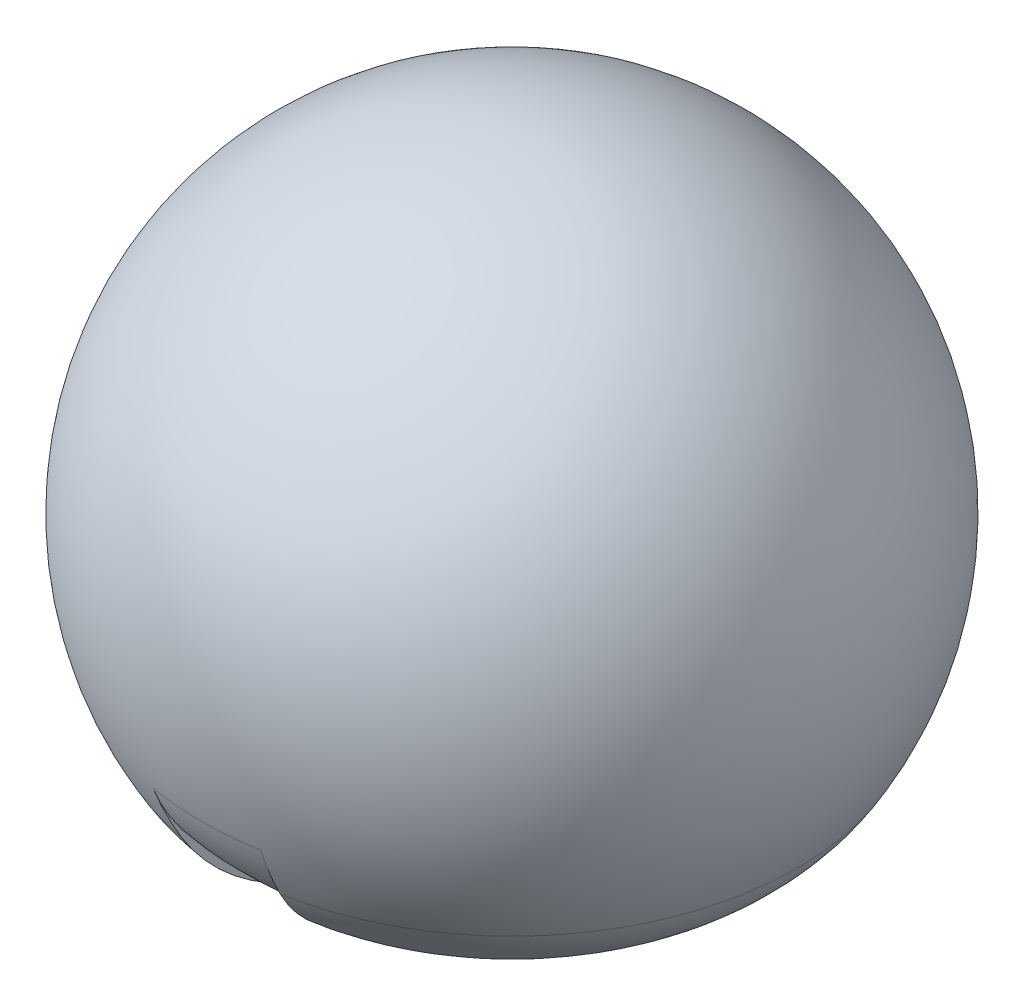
ISO-10303-21;
HEADER;
FILE_DESCRIPTION(('STEP AP214'),'2;1');
FILE_NAME('part.step','',(''),(''),'','','');
FILE_SCHEMA(('AUTOMOTIVE_DESIGN { 1 0 10303 214 1 1 1 1 }'));
ENDSEC;
DATA;
#1=APPLICATION_CONTEXT('core data for automotive mechanical design processes');
#2=APPLICATION_PROTOCOL_DEFINITION('international standard','automotive_design',2000,#1);
#3=PRODUCT_CONTEXT('',#1,'mechanical');
#4=PRODUCT('Part','Part','',(#3));
#5=PRODUCT_RELATED_PRODUCT_CATEGORY('part','',(#4));
#6=PRODUCT_DEFINITION_FORMATION('','',#4);
#7=PRODUCT_DEFINITION_CONTEXT('part definition',#1,'design');
#8=PRODUCT_DEFINITION('design','',#6,#7);
#9=PRODUCT_DEFINITION_SHAPE('','',#8);
#10=(LENGTH_UNIT() NAMED_UNIT(*) SI_UNIT(.MILLI.,.METRE.));
#11=(NAMED_UNIT(*) PLANE_ANGLE_UNIT() SI_UNIT($,.RADIAN.));
#12=(NAMED_UNIT(*) SI_UNIT($,.STERADIAN.) SOLID_ANGLE_UNIT());
#13=UNCERTAINTY_MEASURE_WITH_UNIT(LENGTH_MEASURE(1.E-05),#10,'distance_accuracy_value','');
#14=(GEOMETRIC_REPRESENTATION_CONTEXT(3) GLOBAL_UNCERTAINTY_ASSIGNED_CONTEXT((#13)) GLOBAL_UNIT_ASSIGNED_CONTEXT((#10,
#11,#12)) REPRESENTATION_CONTEXT('',''));
#15=CARTESIAN_POINT('',(0.,0.,0.));
#16=DIRECTION('',(0.,0.,1.));
#17=DIRECTION('',(1.,0.,0.));
#18=AXIS2_PLACEMENT_3D('',#15,#16,#17);
#19=CARTESIAN_POINT('',(-202.363452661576,395.,1147.66017003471));
#20=DIRECTION('',(-0.984807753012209,0.,-0.173648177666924));
#21=DIRECTION('',(-0.173648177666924,0.,0.984807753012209));
#22=AXIS2_PLACEMENT_3D('',#19,#20,#21);
#23=PLANE('',#22);
#24=CARTESIAN_POINT('',(39.0997706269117,199.999999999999,-221.745818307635));
#25=DIRECTION('',(-0.984807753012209,0.,-0.173648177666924));
#26=DIRECTION('',(-0.173648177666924,0.,0.984807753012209));
#27=AXIS2_PLACEMENT_3D('',#24,#25,#26);
#28=CIRCLE('',#27,300.235324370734);
#29=CARTESIAN_POINT('',(-13.0034418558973,189.465191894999,73.7461833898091));
#30=VERTEX_POINT('',#29);
#31=CARTESIAN_POINT('',(2.98472361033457E-13,1.40178752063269,-1.69272087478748E-12));
#32=VERTEX_POINT('',#31);
#33=EDGE_CURVE('E94',#30,#32,#28,.F.);
#34=ORIENTED_EDGE('',*,*,#33,.F.);
#35=CARTESIAN_POINT('',(0.,330.,1.2490952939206E-13));
#36=DIRECTION('',(-0.984807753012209,0.,-0.173648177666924));
#37=DIRECTION('',(-0.173648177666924,0.,0.984807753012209));
#38=AXIS2_PLACEMENT_3D('',#35,#36,#37);
#39=CIRCLE('',#38,159.240765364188);
#40=CARTESIAN_POINT('',(-10.3358010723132,477.698380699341,58.6172407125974));
#41=VERTEX_POINT('',#40);
#42=EDGE_CURVE('E106',#30,#41,#39,.T.);
#43=ORIENTED_EDGE('',*,*,#42,.T.);
#44=CARTESIAN_POINT('',(-42.4257369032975,241.074762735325,240.608310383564));
#45=DIRECTION('',(-0.984807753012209,0.,-0.173648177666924));
#46=DIRECTION('',(-0.173648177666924,0.,0.984807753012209));
#47=AXIS2_PLACEMENT_3D('',#44,#45,#46);
#48=CIRCLE('',#47,300.235324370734);
#49=CARTESIAN_POINT('',(-40.5963866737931,541.125204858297,230.233549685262));
#50=VERTEX_POINT('',#49);
#51=EDGE_CURVE('E57',#41,#50,#48,.F.);
#52=ORIENTED_EDGE('',*,*,#51,.T.);
#53=CARTESIAN_POINT('',(0.,330.,0.));
#54=DIRECTION('',(-0.984807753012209,0.,-0.173648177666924));
#55=DIRECTION('',(-0.173648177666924,0.,0.984807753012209));
#56=AXIS2_PLACEMENT_3D('',#53,#54,#55);
#57=CIRCLE('',#56,315.006993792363);
#58=CARTESIAN_POINT('',(-7.53307391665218,17.9944330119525,42.7221851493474));
#59=VERTEX_POINT('',#58);
#60=EDGE_CURVE('E52',#50,#59,#57,.F.);
#61=ORIENTED_EDGE('',*,*,#60,.T.);
#62=CARTESIAN_POINT('',(-42.4257369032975,241.074762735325,240.608310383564));
#63=DIRECTION('',(-0.984807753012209,0.,-0.173648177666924));
#64=DIRECTION('',(-0.173648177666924,0.,0.984807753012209));
#65=AXIS2_PLACEMENT_3D('',#62,#63,#64);
#66=CIRCLE('',#65,300.235324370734);
#67=CARTESIAN_POINT('',(-91.4169095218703,138.388234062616,518.451056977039));
#68=VERTEX_POINT('',#67);
#69=EDGE_CURVE('E141',#68,#59,#66,.F.);
#70=ORIENTED_EDGE('',*,*,#69,.F.);
#71=CARTESIAN_POINT('',(0.,330.,1.2490952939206E-13));
#72=DIRECTION('',(-0.984807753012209,0.,-0.173648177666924));
#73=DIRECTION('',(-0.173648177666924,0.,0.984807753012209));
#74=AXIS2_PLACEMENT_3D('',#71,#72,#73);
#75=CIRCLE('',#74,560.235324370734);
#76=CARTESIAN_POINT('',(-84.2502795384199,49.8823378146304,477.807078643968));
#77=VERTEX_POINT('',#76);
#78=EDGE_CURVE('E116',#77,#68,#75,.T.);
#79=ORIENTED_EDGE('',*,*,#78,.F.);
#80=CARTESIAN_POINT('',(-39.0997706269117,199.999999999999,221.745818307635));
#81=DIRECTION('',(-0.984807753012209,0.,-0.173648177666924));
#82=DIRECTION('',(-0.173648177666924,0.,0.984807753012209));
#83=AXIS2_PLACEMENT_3D('',#80,#81,#82);
#84=CIRCLE('',#83,300.235324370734);
#85=EDGE_CURVE('E112',#32,#77,#84,.T.);
#86=ORIENTED_EDGE('',*,*,#85,.F.);
#87=EDGE_LOOP('',(#34,#43,#52,#61,#70,#79,#86));
#88=FACE_BOUND('',#87,.T.);
#89=ADVANCED_FACE('F37',(#88),#23,.F.);
#90=CARTESIAN_POINT('',(202.363452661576,395.,1147.66017003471));
#91=DIRECTION('',(-0.984807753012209,0.,0.173648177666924));
#92=DIRECTION('',(0.173648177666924,0.,0.984807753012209));
#93=AXIS2_PLACEMENT_3D('',#90,#91,#92);
#94=PLANE('',#93);
#95=CARTESIAN_POINT('',(0.,330.,1.2490952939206E-13));
#96=DIRECTION('',(-0.984807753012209,0.,0.173648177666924));
#97=DIRECTION('',(0.173648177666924,0.,0.984807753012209));
#98=AXIS2_PLACEMENT_3D('',#95,#96,#97);
#99=CIRCLE('',#98,159.240765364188);
#100=CARTESIAN_POINT('',(13.0034418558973,189.465191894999,73.7461833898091));
#101=VERTEX_POINT('',#100);
#102=CARTESIAN_POINT('',(10.3358010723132,477.698380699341,58.6172407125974));
#103=VERTEX_POINT('',#102);
#104=EDGE_CURVE('E104',#101,#103,#99,.T.);
#105=ORIENTED_EDGE('',*,*,#104,.F.);
#106=CARTESIAN_POINT('',(-39.0997706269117,199.999999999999,-221.745818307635));
#107=DIRECTION('',(-0.984807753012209,0.,0.173648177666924));
#108=DIRECTION('',(0.173648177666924,0.,0.984807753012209));
#109=AXIS2_PLACEMENT_3D('',#106,#107,#108);
#110=CIRCLE('',#109,300.235324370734);
#111=EDGE_CURVE('E89',#101,#32,#110,.F.);
#112=ORIENTED_EDGE('',*,*,#111,.T.);
#113=CARTESIAN_POINT('',(39.0997706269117,199.999999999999,221.745818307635));
#114=DIRECTION('',(-0.984807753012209,0.,0.173648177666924));
#115=DIRECTION('',(0.173648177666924,0.,0.984807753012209));
#116=AXIS2_PLACEMENT_3D('',#113,#114,#115);
#117=CIRCLE('',#116,300.235324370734);
#118=CARTESIAN_POINT('',(84.2502795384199,49.8823378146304,477.807078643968));
#119=VERTEX_POINT('',#118);
#120=EDGE_CURVE('E118',#32,#119,#117,.T.);
#121=ORIENTED_EDGE('',*,*,#120,.T.);
#122=CARTESIAN_POINT('',(0.,330.,1.2490952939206E-13));
#123=DIRECTION('',(-0.984807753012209,0.,0.173648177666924));
#124=DIRECTION('',(0.173648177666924,0.,0.984807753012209));
#125=AXIS2_PLACEMENT_3D('',#122,#123,#124);
#126=CIRCLE('',#125,560.235324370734);
#127=CARTESIAN_POINT('',(91.4169095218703,138.388234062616,518.451056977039));
#128=VERTEX_POINT('',#127);
#129=EDGE_CURVE('E113',#119,#128,#126,.T.);
#130=ORIENTED_EDGE('',*,*,#129,.T.);
#131=CARTESIAN_POINT('',(42.4257369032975,241.074762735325,240.608310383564));
#132=DIRECTION('',(-0.984807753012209,0.,0.173648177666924));
#133=DIRECTION('',(0.173648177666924,0.,0.984807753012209));
#134=AXIS2_PLACEMENT_3D('',#131,#132,#133);
#135=CIRCLE('',#134,300.235324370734);
#136=CARTESIAN_POINT('',(7.53307391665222,17.9944330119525,42.7221851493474));
#137=VERTEX_POINT('',#136);
#138=EDGE_CURVE('E11',#128,#137,#135,.F.);
#139=ORIENTED_EDGE('',*,*,#138,.T.);
#140=CARTESIAN_POINT('',(0.,330.,0.));
#141=DIRECTION('',(-0.984807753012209,0.,0.173648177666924));
#142=DIRECTION('',(0.173648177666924,0.,0.984807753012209));
#143=AXIS2_PLACEMENT_3D('',#140,#141,#142);
#144=CIRCLE('',#143,315.006993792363);
#145=CARTESIAN_POINT('',(40.5963866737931,541.125204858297,230.233549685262));
#146=VERTEX_POINT('',#145);
#147=EDGE_CURVE('E45',#146,#137,#144,.F.);
#148=ORIENTED_EDGE('',*,*,#147,.F.);
#149=CARTESIAN_POINT('',(42.4257369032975,241.074762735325,240.608310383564));
#150=DIRECTION('',(-0.984807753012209,0.,0.173648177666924));
#151=DIRECTION('',(0.173648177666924,0.,0.984807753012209));
#152=AXIS2_PLACEMENT_3D('',#149,#150,#151);
#153=CIRCLE('',#152,300.235324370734);
#154=EDGE_CURVE('E110',#103,#146,#153,.F.);
#155=ORIENTED_EDGE('',*,*,#154,.F.);
#156=EDGE_LOOP('',(#105,#112,#121,#130,#139,#148,#155));
#157=FACE_BOUND('',#156,.T.);
#158=ADVANCED_FACE('F108',(#157),#94,.T.);
#159=CARTESIAN_POINT('',(0.,199.999999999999,-225.166604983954));
#160=DIRECTION('',(-1.,0.,0.));
#161=DIRECTION('',(0.,0.,-1.));
#162=AXIS2_PLACEMENT_3D('',#159,#160,#161);
#163=CIRCLE('',#162,300.235324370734);
#164=TRIMMED_CURVE('',#163,(PARAMETER_VALUE(-2.41880861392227)),
(PARAMETER_VALUE(2.41880861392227)),.T.,.PARAMETER.);
#165=CARTESIAN_POINT('',(0.,199.999999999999,0.));
#166=DIRECTION('',(0.,-1.,0.));
#167=AXIS1_PLACEMENT('',#165,#166);
#168=SURFACE_OF_REVOLUTION('',#164,#167);
#169=CARTESIAN_POINT('',(0.,49.8823378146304,0.));
#170=DIRECTION('',(0.,-1.,0.));
#171=DIRECTION('',(0.,0.,-1.));
#172=AXIS2_PLACEMENT_3D('',#169,#170,#171);
#173=CIRCLE('',#172,485.17802300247);
#174=EDGE_CURVE('E125',#77,#119,#173,.T.);
#175=ORIENTED_EDGE('',*,*,#174,.T.);
#176=ORIENTED_EDGE('',*,*,#120,.F.);
#177=ORIENTED_EDGE('',*,*,#85,.T.);
#178=EDGE_LOOP('',(#175,#176,#177));
#179=FACE_BOUND('',#178,.T.);
#180=ADVANCED_FACE('F39',(#179),#168,.T.);
#181=CARTESIAN_POINT('',(0.,330.,1.2490952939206E-13));
#182=DIRECTION('',(0.,-1.,0.));
#183=DIRECTION('',(-0.173648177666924,0.,0.984807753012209));
#184=AXIS2_PLACEMENT_3D('',#181,#182,#183);
#185=SPHERICAL_SURFACE('',#184,560.235324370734);
#186=CARTESIAN_POINT('',(0.,138.388234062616,0.));
#187=DIRECTION('',(0.,-1.,0.));
#188=DIRECTION('',(0.,0.,-1.));
#189=AXIS2_PLACEMENT_3D('',#186,#187,#188);
#190=CIRCLE('',#189,526.449000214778);
#191=EDGE_CURVE('E142',#128,#68,#190,.T.);
#192=ORIENTED_EDGE('',*,*,#191,.F.);
#193=ORIENTED_EDGE('',*,*,#129,.F.);
#194=ORIENTED_EDGE('',*,*,#174,.F.);
#195=ORIENTED_EDGE('',*,*,#78,.T.);
#196=EDGE_LOOP('',(#192,#193,#194,#195));
#197=FACE_BOUND('',#196,.T.);
#198=ADVANCED_FACE('F155',(#197),#185,.T.);
#199=CARTESIAN_POINT('',(0.,330.,1.2490952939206E-13));
#200=DIRECTION('',(0.,-1.,0.));
#201=DIRECTION('',(0.173648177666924,0.,-0.984807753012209));
#202=AXIS2_PLACEMENT_3D('',#199,#200,#201);
#203=SPHERICAL_SURFACE('',#202,159.240765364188);
#204=ORIENTED_EDGE('',*,*,#42,.F.);
#205=CARTESIAN_POINT('',(0.,189.465191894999,0.));
#206=DIRECTION('',(0.,-1.,0.));
#207=DIRECTION('',(0.,0.,-1.));
#208=AXIS2_PLACEMENT_3D('',#205,#206,#207);
#209=CIRCLE('',#208,74.8838371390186);
#210=EDGE_CURVE('E92',#101,#30,#209,.T.);
#211=ORIENTED_EDGE('',*,*,#210,.F.);
#212=ORIENTED_EDGE('',*,*,#104,.T.);
#213=CARTESIAN_POINT('',(0.,477.698380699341,0.));
#214=DIRECTION('',(0.,-1.,0.));
#215=DIRECTION('',(0.,0.,-1.));
#216=AXIS2_PLACEMENT_3D('',#213,#214,#215);
#217=CIRCLE('',#216,59.5215061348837);
#218=EDGE_CURVE('E145',#103,#41,#217,.T.);
#219=ORIENTED_EDGE('',*,*,#218,.T.);
#220=EDGE_LOOP('',(#204,#211,#212,#219));
#221=FACE_BOUND('',#220,.T.);
#222=ADVANCED_FACE('F102',(#221),#203,.F.);
#223=CARTESIAN_POINT('',(0.,241.074762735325,0.));
#224=DIRECTION('',(0.,-1.,0.));
#225=DIRECTION('',(0.,0.,-1.));
#226=AXIS2_PLACEMENT_3D('',#223,#224,#225);
#227=DEGENERATE_TOROIDAL_SURFACE('',#226,244.320081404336,300.235324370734,.T.);
#228=ORIENTED_EDGE('',*,*,#191,.T.);
#229=ORIENTED_EDGE('',*,*,#69,.T.);
#230=CARTESIAN_POINT('',(0.,17.9944330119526,0.));
#231=DIRECTION('',(0.,-1.,0.));
#232=DIRECTION('',(0.,0.,-1.));
#233=AXIS2_PLACEMENT_3D('',#230,#231,#232);
#234=CIRCLE('',#233,43.3812437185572);
#235=EDGE_CURVE('E133',#137,#59,#234,.T.);
#236=ORIENTED_EDGE('',*,*,#235,.F.);
#237=ORIENTED_EDGE('',*,*,#138,.F.);
#238=EDGE_LOOP('',(#228,#229,#236,#237));
#239=FACE_BOUND('',#238,.T.);
#240=ADVANCED_FACE('F139',(#239),#227,.T.);
#241=CARTESIAN_POINT('',(0.,330.,0.));
#242=DIRECTION('',(0.,-1.,0.));
#243=DIRECTION('',(0.173648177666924,0.,-0.984807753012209));
#244=AXIS2_PLACEMENT_3D('',#241,#242,#243);
#245=SPHERICAL_SURFACE('',#244,315.006993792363);
#246=ORIENTED_EDGE('',*,*,#60,.F.);
#247=CARTESIAN_POINT('',(0.,541.125204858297,0.));
#248=DIRECTION('',(0.,-1.,0.));
#249=DIRECTION('',(0.,0.,-1.));
#250=AXIS2_PLACEMENT_3D('',#247,#248,#249);
#251=CIRCLE('',#250,233.785273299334);
#252=EDGE_CURVE('E135',#146,#50,#251,.T.);
#253=ORIENTED_EDGE('',*,*,#252,.F.);
#254=ORIENTED_EDGE('',*,*,#147,.T.);
#255=ORIENTED_EDGE('',*,*,#235,.T.);
#256=EDGE_LOOP('',(#246,#253,#254,#255));
#257=FACE_BOUND('',#256,.T.);
#258=ADVANCED_FACE('F132',(#257),#245,.F.);
#259=CARTESIAN_POINT('',(0.,241.074762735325,0.));
#260=DIRECTION('',(0.,-1.,0.));
#261=DIRECTION('',(0.,0.,-1.));
#262=AXIS2_PLACEMENT_3D('',#259,#260,#261);
#263=DEGENERATE_TOROIDAL_SURFACE('',#262,244.320081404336,300.235324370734,.T.);
#264=ORIENTED_EDGE('',*,*,#51,.F.);
#265=ORIENTED_EDGE('',*,*,#218,.F.);
#266=ORIENTED_EDGE('',*,*,#154,.T.);
#267=ORIENTED_EDGE('',*,*,#252,.T.);
#268=EDGE_LOOP('',(#264,#265,#266,#267));
#269=FACE_BOUND('',#268,.T.);
#270=ADVANCED_FACE('F176',(#269),#263,.F.);
#271=CARTESIAN_POINT('',(0.,199.999999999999,225.166604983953));
#272=DIRECTION('',(-1.,0.,0.));
#273=DIRECTION('',(0.,0.,-1.));
#274=AXIS2_PLACEMENT_3D('',#271,#272,#273);
#275=CIRCLE('',#274,300.235324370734);
#276=TRIMMED_CURVE('',#275,(PARAMETER_VALUE(-0.72278403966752)),
(PARAMETER_VALUE(0.72278403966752)),.T.,.PARAMETER.);
#277=CARTESIAN_POINT('',(0.,199.999999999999,0.));
#278=DIRECTION('',(0.,-1.,0.));
#279=AXIS1_PLACEMENT('',#277,#278);
#280=SURFACE_OF_REVOLUTION('',#276,#279);
#281=ORIENTED_EDGE('',*,*,#210,.T.);
#282=ORIENTED_EDGE('',*,*,#33,.T.);
#283=ORIENTED_EDGE('',*,*,#111,.F.);
#284=EDGE_LOOP('',(#281,#282,#283));
#285=FACE_BOUND('',#284,.T.);
#286=ADVANCED_FACE('F91',(#285),#280,.T.);
#287=CLOSED_SHELL('',(#89,#158,#180,#198,#222,#240,#258,#270,#286));
#288=MANIFOLD_SOLID_BREP('B2',#287);
#289=ADVANCED_BREP_SHAPE_REPRESENTATION('',(#18,#288),#14);
#290=SHAPE_DEFINITION_REPRESENTATION(#9,#289);
ENDSEC;
END-ISO-10303-21;
